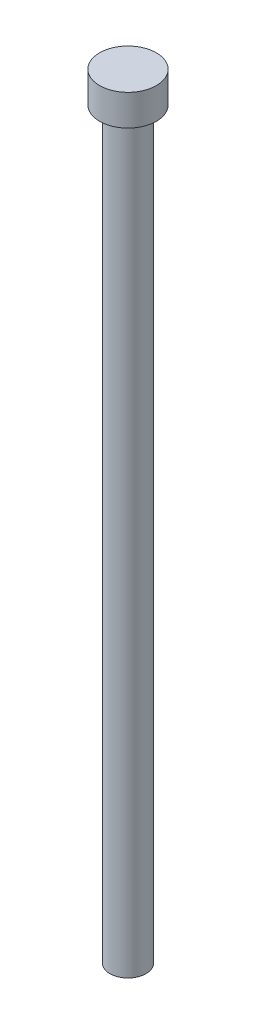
from build123d import *

# Parameters (mm, degrees)
HEADDIA_R           = 5.5
HEADTHICKNESS_DEPTH = 6
PINDIA_R            = 3.5
LENGTH_DEPTH        = 150
RADIUS_R            = 0.3


with BuildPart() as part:
    # HeadDia → HeadThickness (new body)
    with BuildSketch(Plane(origin=(0, 0, 0), x_dir=(1, 0, 0), z_dir=(0, 1, 0))):
        with Locations(Location((0, 0, 0), (0, 0, 270))):
            Circle(HEADDIA_R)
    extrude(amount=-HEADTHICKNESS_DEPTH)

    # PinDia → Length (add)
    with BuildSketch(Plane.XZ):
        with Locations(Location((0, 0, 0), (0, 0, 90))):
            Circle(PINDIA_R)
    extrude(amount=LENGTH_DEPTH)

    # Radius
    radius_edges = [part.edges().sort_by_distance(p)[0] for p in [
        (0, -6, -3.5),
    ]]
    fillet(radius_edges, radius=RADIUS_R)


solid = part.part
